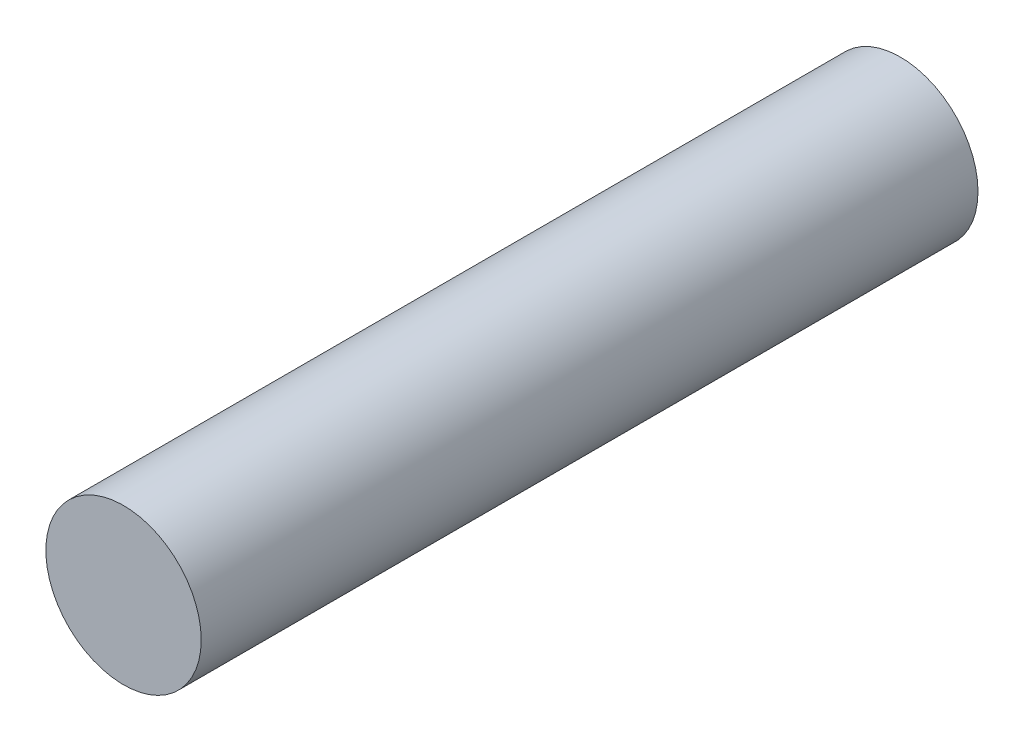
ISO-10303-21;
HEADER;
FILE_DESCRIPTION(('STEP AP214'),'2;1');
FILE_NAME('part.step','',(''),(''),'','','');
FILE_SCHEMA(('AUTOMOTIVE_DESIGN { 1 0 10303 214 1 1 1 1 }'));
ENDSEC;
DATA;
#1=APPLICATION_CONTEXT('core data for automotive mechanical design processes');
#2=APPLICATION_PROTOCOL_DEFINITION('international standard','automotive_design',2000,#1);
#3=PRODUCT_CONTEXT('',#1,'mechanical');
#4=PRODUCT('Part','Part','',(#3));
#5=PRODUCT_RELATED_PRODUCT_CATEGORY('part','',(#4));
#6=PRODUCT_DEFINITION_FORMATION('','',#4);
#7=PRODUCT_DEFINITION_CONTEXT('part definition',#1,'design');
#8=PRODUCT_DEFINITION('design','',#6,#7);
#9=PRODUCT_DEFINITION_SHAPE('','',#8);
#10=(LENGTH_UNIT() NAMED_UNIT(*) SI_UNIT(.MILLI.,.METRE.));
#11=(NAMED_UNIT(*) PLANE_ANGLE_UNIT() SI_UNIT($,.RADIAN.));
#12=(NAMED_UNIT(*) SI_UNIT($,.STERADIAN.) SOLID_ANGLE_UNIT());
#13=UNCERTAINTY_MEASURE_WITH_UNIT(LENGTH_MEASURE(1.E-05),#10,'distance_accuracy_value','');
#14=(GEOMETRIC_REPRESENTATION_CONTEXT(3) GLOBAL_UNCERTAINTY_ASSIGNED_CONTEXT((#13)) GLOBAL_UNIT_ASSIGNED_CONTEXT((#10,
#11,#12)) REPRESENTATION_CONTEXT('',''));
#15=CARTESIAN_POINT('',(0.,0.,0.));
#16=DIRECTION('',(0.,0.,1.));
#17=DIRECTION('',(1.,0.,0.));
#18=AXIS2_PLACEMENT_3D('',#15,#16,#17);
#19=CARTESIAN_POINT('',(0.,0.,25.));
#20=DIRECTION('',(0.,0.,-1.));
#21=DIRECTION('',(-1.,0.,0.));
#22=AXIS2_PLACEMENT_3D('',#19,#20,#21);
#23=CYLINDRICAL_SURFACE('',#22,2.5);
#24=CARTESIAN_POINT('',(0.,0.,25.));
#25=DIRECTION('',(0.,0.,1.));
#26=DIRECTION('',(1.,0.,0.));
#27=AXIS2_PLACEMENT_3D('',#24,#25,#26);
#28=CIRCLE('',#27,2.5);
#29=CARTESIAN_POINT('',(2.5,0.,25.));
#30=VERTEX_POINT('',#29);
#31=EDGE_CURVE('E10',#30,#30,#28,.T.);
#32=ORIENTED_EDGE('',*,*,#31,.F.);
#33=EDGE_LOOP('',(#32));
#34=FACE_BOUND('',#33,.T.);
#35=CARTESIAN_POINT('',(0.,0.,0.));
#36=DIRECTION('',(0.,0.,1.));
#37=DIRECTION('',(1.,0.,0.));
#38=AXIS2_PLACEMENT_3D('',#35,#36,#37);
#39=CIRCLE('',#38,2.5);
#40=CARTESIAN_POINT('',(2.5,0.,0.));
#41=VERTEX_POINT('',#40);
#42=EDGE_CURVE('E40',#41,#41,#39,.T.);
#43=ORIENTED_EDGE('',*,*,#42,.T.);
#44=EDGE_LOOP('',(#43));
#45=FACE_BOUND('',#44,.T.);
#46=ADVANCED_FACE('F37',(#34,#45),#23,.T.);
#47=CARTESIAN_POINT('',(0.,0.,25.));
#48=DIRECTION('',(0.,0.,1.));
#49=DIRECTION('',(1.,0.,0.));
#50=AXIS2_PLACEMENT_3D('',#47,#48,#49);
#51=PLANE('',#50);
#52=ORIENTED_EDGE('',*,*,#31,.T.);
#53=EDGE_LOOP('',(#52));
#54=FACE_BOUND('',#53,.T.);
#55=ADVANCED_FACE('F54',(#54),#51,.T.);
#56=CARTESIAN_POINT('',(0.,0.,0.));
#57=DIRECTION('',(0.,0.,1.));
#58=DIRECTION('',(1.,0.,0.));
#59=AXIS2_PLACEMENT_3D('',#56,#57,#58);
#60=PLANE('',#59);
#61=ORIENTED_EDGE('',*,*,#42,.F.);
#62=EDGE_LOOP('',(#61));
#63=FACE_BOUND('',#62,.T.);
#64=ADVANCED_FACE('F52',(#63),#60,.F.);
#65=CLOSED_SHELL('',(#46,#55,#64));
#66=MANIFOLD_SOLID_BREP('B2',#65);
#67=ADVANCED_BREP_SHAPE_REPRESENTATION('',(#18,#66),#14);
#68=SHAPE_DEFINITION_REPRESENTATION(#9,#67);
ENDSEC;
END-ISO-10303-21;
